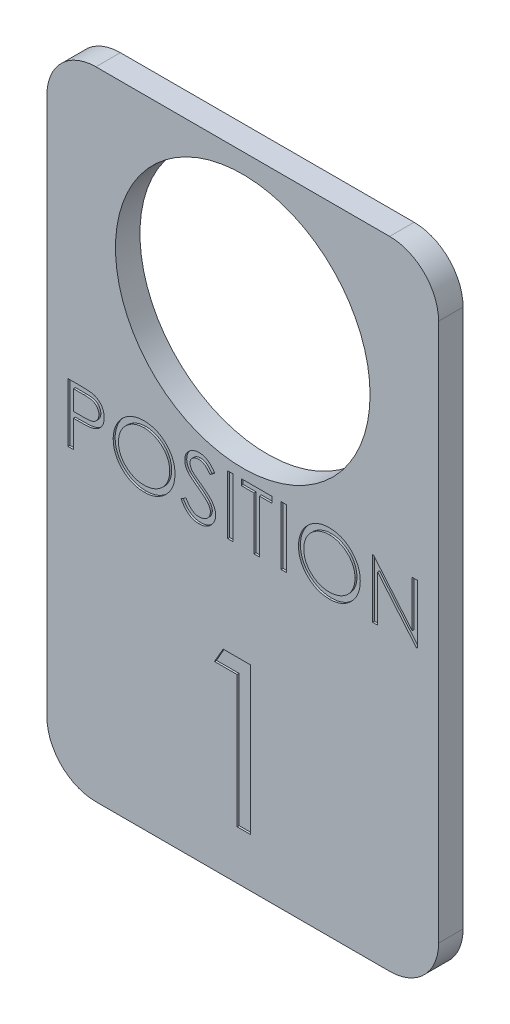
from build123d import *

# Parameters (mm, degrees)
SKETCH1_W           = 25.4
SKETCH1_H           = 41.275
SKETCH1_R           = 8.255
BOSS_EXTRUDE1_DEPTH = 1.5875
FILLET1_R           = 3.175
SKETCH2_W           = 0.341923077
SKETCH2_H           = 3.81
CUT_EXTRUDE1_DEPTH  = 0.127
CUT_EXTRUDE2_DEPTH  = 0.127


with BuildPart() as part:
    # Sketch1 → Boss-Extrude1 (new body)
    with BuildSketch(Plane.XY):
        with Locations((0, -11.1125)):
            Rectangle(SKETCH1_W, SKETCH1_H)
        Circle(SKETCH1_R, mode=Mode.SUBTRACT)
    extrude(amount=BOSS_EXTRUDE1_DEPTH)

    # Fillet1
    fillet1_edges = [part.edges().sort_by_distance(p)[0] for p in [
        (12.7, -31.75, 0.79375),
        (-12.7, -31.75, 0.79375),
        (-12.7, 9.525, 0.79375),
        (12.7, 9.525, 0.79375),
    ]]
    fillet(fillet1_edges, radius=FILLET1_R)

    # Sketch2 → Cut-Extrude1 (cut)
    # profile 1 of 8: a face of its own
    with BuildSketch(Plane.XY.offset(1.5875)):
        with BuildLine():
            Line((-11.332307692, -8.89), (-10.585114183, -8.89))
            add(Edge.make_bspline(
                [(-10.585114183, -8.89), (-10.533721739, -8.890056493), (-10.435251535, -8.890164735), (-10.294047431, -8.893446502), (-10.165803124, -8.897829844), (-10.050795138, -8.903906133), (-9.948669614, -8.911086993), (-9.859888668, -8.921158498), (-9.783754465, -8.93167442), (-9.738136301, -8.942365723), (-9.717331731, -8.947241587)],
                knots=[0, 0, 0, 0, 1.415646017, 2.712440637, 3.8905458, 4.950247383, 5.884950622, 6.709939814, 7.411656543, 8, 8, 8, 8], degree=3))
            add(Edge.make_bspline(
                [(-9.717331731, -8.947241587), (-9.690995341, -8.954450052), (-9.638943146, -8.968697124), (-9.563939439, -8.997232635), (-9.492579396, -9.031067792), (-9.424618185, -9.06962928), (-9.360890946, -9.114571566), (-9.300446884, -9.164072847), (-9.24381942, -9.219276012), (-9.191326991, -9.279561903), (-9.143119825, -9.343918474), (-9.101612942, -9.413306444), (-9.066857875, -9.486557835), (-9.037049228, -9.563621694), (-9.015595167, -9.64514516), (-8.999433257, -9.730561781), (-8.989174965, -9.819862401), (-8.988192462, -9.880887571), (-8.987692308, -9.911953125)],
                knots=[0, 0, 0, 0, 0.999701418, 1.975846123, 2.934577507, 3.890451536, 4.834027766, 5.787354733, 6.749476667, 7.726910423, 8.712836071, 9.690891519, 10.682875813, 11.679750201, 12.712814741, 13.765529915, 14.8625177, 16, 16, 16, 16], degree=3))
            add(Edge.make_bspline(
                [(-8.987692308, -9.911953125), (-8.988151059, -9.943279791), (-8.989048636, -10.004572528), (-8.999821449, -10.094241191), (-9.014332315, -10.179931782), (-9.03664482, -10.261454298), (-9.065868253, -10.338324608), (-9.100149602, -10.411717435), (-9.141497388, -10.480384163), (-9.189007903, -10.544574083), (-9.241859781, -10.604347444), (-9.299829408, -10.659271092), (-9.362682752, -10.709023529), (-9.430220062, -10.753716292), (-9.503099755, -10.792312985), (-9.580216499, -10.826883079), (-9.662240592, -10.855916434), (-9.719001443, -10.871189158), (-9.747860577, -10.878954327)],
                knots=[0, 0, 0, 0, 1.121902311, 2.195077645, 3.232258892, 4.234102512, 5.217864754, 6.176164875, 7.132989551, 8.084763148, 9.034132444, 9.988522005, 10.94243251, 11.903244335, 12.886203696, 13.894208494, 14.929344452, 16, 16, 16, 16], degree=3))
            add(Edge.make_bspline(
                [(-9.747860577, -10.878954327), (-9.771730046, -10.884030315), (-9.824041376, -10.895154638), (-9.910193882, -10.907573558), (-10.010500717, -10.918173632), (-10.12482497, -10.926121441), (-10.253064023, -10.932925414), (-10.395287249, -10.938333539), (-10.55177383, -10.94130518), (-10.660926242, -10.941458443), (-10.717914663, -10.941538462)],
                knots=[0, 0, 0, 0, 0.601384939, 1.31797006, 2.144135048, 3.087295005, 4.142315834, 5.309527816, 6.595305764, 8, 8, 8, 8], degree=3))
            Line((-10.717914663, -10.941538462), (-10.990384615, -10.941538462))
            Line((-10.990384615, -10.941538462), (-10.990384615, -12.7))
            Line((-10.990384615, -12.7), (-11.332307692, -12.7))
            Line((-11.332307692, -12.7), (-11.332307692, -8.89))
        make_face()
        with BuildLine():
            Line((-10.990384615, -9.280769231), (-10.990384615, -10.550769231))
            Line((-10.990384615, -10.550769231), (-10.323329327, -10.559164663))
            add(Edge.make_bspline(
                [(-10.323329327, -10.559164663), (-10.290759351, -10.559181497), (-10.227883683, -10.559213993), (-10.137057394, -10.554875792), (-10.052791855, -10.549867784), (-9.975345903, -10.54253525), (-9.904684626, -10.532170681), (-9.840690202, -10.521707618), (-9.783858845, -10.506570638), (-9.717348, -10.48618924), (-9.643234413, -10.451428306), (-9.562606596, -10.40097314), (-9.494276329, -10.33665957), (-9.435146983, -10.26434813), (-9.388223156, -10.183903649), (-9.353872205, -10.097831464), (-9.33368883, -10.007014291), (-9.330982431, -9.944869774), (-9.329615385, -9.913479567)],
                knots=[0, 0, 0, 0, 1.160613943, 2.240541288, 3.23993089, 4.169200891, 5.011653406, 5.7853311, 6.478053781, 7.106038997, 8.262395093, 9.384106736, 10.481365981, 11.59014053, 12.70357646, 13.786202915, 14.881775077, 16, 16, 16, 16], degree=3))
            add(Edge.make_bspline(
                [(-9.329615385, -9.913479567), (-9.330989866, -9.882848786), (-9.333722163, -9.821958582), (-9.354030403, -9.732718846), (-9.38815637, -9.647553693), (-9.435461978, -9.568117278), (-9.492874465, -9.496066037), (-9.559603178, -9.433476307), (-9.635491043, -9.383160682), (-9.706082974, -9.350685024), (-9.76878598, -9.330856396), (-9.823249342, -9.316982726), (-9.884743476, -9.305905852), (-9.953288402, -9.296936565), (-10.028352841, -9.289258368), (-10.110581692, -9.28404849), (-10.199663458, -9.280998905), (-10.261505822, -9.280847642), (-10.293563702, -9.280769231)],
                knots=[0, 0, 0, 0, 1.120700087, 2.227813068, 3.331159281, 4.466773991, 5.599788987, 6.693661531, 7.80175334, 8.91857717, 9.525282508, 10.207424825, 10.974604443, 11.810962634, 12.737642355, 13.736264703, 14.826523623, 16, 16, 16, 16], degree=3))
            Line((-10.293563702, -9.280769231), (-10.990384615, -9.280769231))
        make_face(mode=Mode.SUBTRACT)
    # profile 2 of 8: a face of its own
    with BuildSketch(Plane.XY.offset(1.5875)):
        with BuildLine():
            add(Edge.make_bspline(
                [(-6.423269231, -8.792307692), (-6.352720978, -8.79409456), (-6.21415839, -8.797604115), (-6.010514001, -8.824469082), (-5.816100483, -8.870946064), (-5.629334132, -8.932845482), (-5.452448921, -9.015418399), (-5.284113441, -9.115224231), (-5.124728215, -9.233308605), (-4.976441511, -9.368758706), (-4.840743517, -9.516133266), (-4.721190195, -9.673407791), (-4.620995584, -9.839631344), (-4.538715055, -10.01430442), (-4.474164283, -10.197031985), (-4.429620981, -10.3887882), (-4.401167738, -10.588330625), (-4.397841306, -10.724431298), (-4.396153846, -10.793473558)],
                knots=[0, 0, 0, 0, 1.065120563, 2.091984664, 3.0946048, 4.079830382, 5.057816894, 6.036188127, 7.030412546, 8.04752943, 9.064399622, 10.05169764, 11.02544977, 11.989514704, 12.962713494, 13.945757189, 14.957906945, 16, 16, 16, 16], degree=3))
            add(Edge.make_bspline(
                [(-4.396153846, -10.793473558), (-4.397841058, -10.862007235), (-4.401166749, -10.997095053), (-4.429653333, -11.195371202), (-4.474329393, -11.385969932), (-4.538115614, -11.568573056), (-4.620003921, -11.743373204), (-4.720865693, -11.909910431), (-4.839673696, -12.068239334), (-4.974881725, -12.216625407), (-5.122275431, -12.352694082), (-5.28036895, -12.471260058), (-5.445606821, -12.573285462), (-5.620115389, -12.654692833), (-5.801580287, -12.719758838), (-5.991625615, -12.764120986), (-6.189360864, -12.792736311), (-6.3242033, -12.796022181), (-6.392740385, -12.797692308)],
                knots=[0, 0, 0, 0, 1.043624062, 2.057103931, 3.04512605, 4.022047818, 4.998200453, 5.980619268, 6.982898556, 8.009068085, 9.034988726, 10.034168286, 11.015286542, 11.987931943, 12.962482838, 13.94673481, 14.956375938, 16, 16, 16, 16], degree=3))
            add(Edge.make_bspline(
                [(-6.392740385, -12.797692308), (-6.461782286, -12.796005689), (-6.597882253, -12.792680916), (-6.797675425, -12.764180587), (-6.989566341, -12.719613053), (-7.173006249, -12.655921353), (-7.348097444, -12.573606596), (-7.515182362, -12.473235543), (-7.673590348, -12.354138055), (-7.822008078, -12.21897387), (-7.957806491, -12.07182998), (-8.07619884, -11.914167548), (-8.176592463, -11.749079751), (-8.258630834, -11.576108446), (-8.323579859, -11.396089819), (-8.367889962, -11.207823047), (-8.396558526, -11.012381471), (-8.399862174, -10.879311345), (-8.401538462, -10.811790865)],
                knots=[0, 0, 0, 0, 1.053102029, 2.075944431, 3.073151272, 4.055350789, 5.033113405, 6.020478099, 7.024410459, 8.052272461, 9.079885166, 10.07527673, 11.055994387, 12.023226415, 12.992069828, 13.970394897, 14.97016774, 16, 16, 16, 16], degree=3))
            add(Edge.make_bspline(
                [(-8.401538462, -10.811790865), (-8.400956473, -10.766470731), (-8.399799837, -10.676402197), (-8.385875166, -10.542653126), (-8.365669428, -10.41105501), (-8.336711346, -10.281982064), (-8.298838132, -10.155750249), (-8.254150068, -10.03148899), (-8.199569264, -9.910457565), (-8.13786833, -9.792082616), (-8.069003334, -9.678209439), (-7.992938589, -9.57057195), (-7.912345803, -9.468266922), (-7.823993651, -9.373945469), (-7.730794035, -9.284863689), (-7.631235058, -9.20239056), (-7.525924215, -9.125782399), (-7.414408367, -9.056744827), (-7.299435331, -8.994305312), (-7.180915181, -8.940723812), (-7.060457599, -8.894735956), (-6.937498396, -8.857462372), (-6.812364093, -8.82803607), (-6.684781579, -8.807998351), (-6.554852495, -8.794038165), (-6.467319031, -8.792886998), (-6.423269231, -8.792307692)],
                knots=[0, 0, 0, 0, 1.037015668, 2.060948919, 3.074880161, 4.083647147, 5.086022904, 6.090072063, 7.104153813, 8.122640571, 9.144368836, 10.147691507, 11.138137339, 12.123020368, 13.103399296, 14.087645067, 15.080126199, 16.082011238, 17.087798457, 18.072939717, 19.057185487, 20.037253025, 21.01195951, 21.997135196, 22.992090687, 24, 24, 24, 24], degree=3))
        make_face()
        with BuildLine():
            add(Edge.make_bspline(
                [(-6.406478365, -9.183076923), (-6.442634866, -9.183517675), (-6.51460221, -9.184394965), (-6.621591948, -9.19595093), (-6.727174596, -9.212420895), (-6.831371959, -9.235913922), (-6.933748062, -9.267922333), (-7.035257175, -9.304760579), (-7.134973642, -9.349632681), (-7.232568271, -9.400330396), (-7.327181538, -9.456445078), (-7.416458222, -9.518462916), (-7.500629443, -9.584929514), (-7.579489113, -9.655999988), (-7.652805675, -9.732036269), (-7.722022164, -9.811885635), (-7.784364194, -9.897830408), (-7.841498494, -9.987540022), (-7.892626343, -10.080897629), (-7.938090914, -10.176920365), (-7.975280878, -10.276391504), (-8.005611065, -10.378231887), (-8.030756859, -10.482280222), (-8.046686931, -10.589325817), (-8.058369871, -10.698830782), (-8.059197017, -10.772833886), (-8.059615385, -10.810264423)],
                knots=[0, 0, 0, 0, 1.008559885, 2.007477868, 2.99961109, 3.989939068, 4.984837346, 5.991145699, 7.001802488, 8.033829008, 9.059044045, 10.069351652, 11.065060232, 12.050310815, 13.029377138, 14.011219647, 14.996725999, 15.989392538, 16.977580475, 17.965360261, 18.951710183, 19.937753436, 20.929683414, 21.935841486, 22.955955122, 24, 24, 24, 24], degree=3))
            add(Edge.make_bspline(
                [(-8.059615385, -10.810264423), (-8.058227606, -10.865305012), (-8.055497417, -10.973586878), (-8.031595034, -11.132265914), (-7.994777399, -11.28476202), (-7.940504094, -11.430240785), (-7.872630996, -11.569952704), (-7.788781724, -11.702658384), (-7.689439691, -11.82839369), (-7.576594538, -11.946280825), (-7.453234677, -12.053881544), (-7.322243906, -12.148329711), (-7.18502555, -12.228242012), (-7.041221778, -12.293344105), (-6.891600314, -12.344931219), (-6.735197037, -12.380286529), (-6.573053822, -12.403555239), (-6.462530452, -12.405789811), (-6.406478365, -12.406923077)],
                knots=[0, 0, 0, 0, 1.032063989, 2.030389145, 3.003944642, 3.970395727, 4.937377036, 5.913328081, 6.909231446, 7.93887556, 8.970685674, 9.976071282, 10.964166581, 11.944589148, 12.933237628, 13.927779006, 14.949070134, 16, 16, 16, 16], degree=3))
            add(Edge.make_bspline(
                [(-6.406478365, -12.406923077), (-6.368803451, -12.406405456), (-6.29408278, -12.40537886), (-6.182944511, -12.395038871), (-6.073808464, -12.378457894), (-5.966827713, -12.354584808), (-5.862123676, -12.324706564), (-5.759259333, -12.289210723), (-5.659330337, -12.244926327), (-5.561076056, -12.195997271), (-5.467027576, -12.140218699), (-5.377247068, -12.080305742), (-5.293997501, -12.013937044), (-5.215196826, -11.943922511), (-5.141579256, -11.868850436), (-5.073642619, -11.788818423), (-5.011615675, -11.703321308), (-4.954503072, -11.613747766), (-4.903554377, -11.520134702), (-4.859163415, -11.423763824), (-4.821503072, -11.324872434), (-4.791100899, -11.223317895), (-4.767277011, -11.119293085), (-4.750861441, -11.01265872), (-4.739378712, -10.903628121), (-4.738513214, -10.829884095), (-4.738076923, -10.792710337)],
                knots=[0, 0, 0, 0, 1.047197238, 2.076906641, 3.100256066, 4.114471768, 5.12198147, 6.126382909, 7.136867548, 8.15857795, 9.17633901, 10.174870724, 11.156907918, 12.133735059, 13.104061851, 14.077631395, 15.04955518, 16.038496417, 17.029181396, 18.010275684, 18.986308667, 19.968651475, 20.955262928, 21.950658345, 22.966943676, 24, 24, 24, 24], degree=3))
            add(Edge.make_bspline(
                [(-4.738076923, -10.792710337), (-4.738513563, -10.755790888), (-4.739379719, -10.68255436), (-4.750855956, -10.574284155), (-4.767294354, -10.468417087), (-4.790984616, -10.365368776), (-4.821519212, -10.265112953), (-4.859169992, -10.167743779), (-4.903567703, -10.072898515), (-4.954521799, -9.980811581), (-5.011797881, -9.89244708), (-5.074384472, -9.807971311), (-5.143362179, -9.728970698), (-5.216760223, -9.653494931), (-5.296411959, -9.583153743), (-5.381956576, -9.517923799), (-5.472355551, -9.456230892), (-5.568070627, -9.400577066), (-5.666851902, -9.349181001), (-5.768213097, -9.305147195), (-5.871005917, -9.267730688), (-5.974968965, -9.235817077), (-6.080977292, -9.212512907), (-6.188314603, -9.195936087), (-6.296832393, -9.184398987), (-6.369813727, -9.18351901), (-6.406478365, -9.183076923)],
                knots=[0, 0, 0, 0, 1.02996197, 2.043119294, 3.035359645, 4.018872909, 4.991431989, 5.957985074, 6.929999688, 7.912076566, 8.892894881, 9.867085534, 10.843653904, 11.817741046, 12.803660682, 13.806313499, 14.818574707, 15.856120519, 16.894564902, 17.924820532, 18.937903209, 19.946497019, 20.957711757, 21.963978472, 22.977135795, 24, 24, 24, 24], degree=3))
        make_face(mode=Mode.SUBTRACT)
    # profile 3 of 8: a face of its own
    with BuildSketch(Plane.XY.offset(1.5875)):
        with BuildLine():
            Line((-4.005384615, -11.965018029), (-3.683305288, -11.771923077))
            add(Edge.make_bspline(
                [(-3.683305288, -11.771923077), (-3.653349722, -11.82206745), (-3.595956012, -11.918142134), (-3.500214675, -12.04796303), (-3.401009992, -12.158302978), (-3.297607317, -12.248520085), (-3.190637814, -12.319548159), (-3.079403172, -12.369842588), (-2.964278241, -12.401210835), (-2.885929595, -12.40502093), (-2.846814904, -12.406923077)],
                knots=[0, 0, 0, 0, 1.272034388, 2.437168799, 3.508375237, 4.49857839, 5.41946034, 6.295179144, 7.148887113, 8, 8, 8, 8], degree=3))
            add(Edge.make_bspline(
                [(-2.846814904, -12.406923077), (-2.813410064, -12.405992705), (-2.747184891, -12.40414824), (-2.649689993, -12.386425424), (-2.555004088, -12.359197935), (-2.465078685, -12.320204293), (-2.381154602, -12.273027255), (-2.307559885, -12.216044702), (-2.243937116, -12.152247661), (-2.19189348, -12.081073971), (-2.151964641, -12.004528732), (-2.121275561, -11.925960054), (-2.104244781, -11.844133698), (-2.101679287, -11.789040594), (-2.100384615, -11.761237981)],
                knots=[0, 0, 0, 0, 1.095163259, 2.171163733, 3.241058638, 4.321873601, 5.38011039, 6.391990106, 7.366004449, 8.327778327, 9.272591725, 10.192022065, 11.087607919, 12, 12, 12, 12], degree=3))
            add(Edge.make_bspline(
                [(-2.100384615, -11.761237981), (-2.101989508, -11.729516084), (-2.10525202, -11.665030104), (-2.132827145, -11.569889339), (-2.176205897, -11.475735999), (-2.21622466, -11.41749605), (-2.237001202, -11.387259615)],
                knots=[0, 0, 0, 0, 0.938893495, 1.908633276, 2.914225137, 4, 4, 4, 4], degree=3))
            add(Edge.make_bspline(
                [(-2.237001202, -11.387259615), (-2.254059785, -11.365437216), (-2.289872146, -11.319623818), (-2.351439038, -11.251430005), (-2.423683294, -11.18108824), (-2.504132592, -11.105912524), (-2.595717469, -11.029399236), (-2.69556942, -10.947899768), (-2.806237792, -10.86451348), (-2.883852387, -10.808590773), (-2.92390024, -10.779735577)],
                knots=[0, 0, 0, 0, 0.722233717, 1.516239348, 2.393582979, 3.351407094, 4.387010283, 5.505090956, 6.712668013, 8, 8, 8, 8], degree=3))
            add(Edge.make_bspline(
                [(-2.92390024, -10.779735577), (-2.963985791, -10.751183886), (-3.04062631, -10.696595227), (-3.14780551, -10.615579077), (-3.243648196, -10.541508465), (-3.327728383, -10.473686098), (-3.400009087, -10.412102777), (-3.461059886, -10.357349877), (-3.509325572, -10.307946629), (-3.536164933, -10.275897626), (-3.548215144, -10.261508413)],
                knots=[0, 0, 0, 0, 1.452282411, 2.77665338, 3.964542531, 5.026858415, 5.96415736, 6.766646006, 7.446254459, 8, 8, 8, 8], degree=3))
            add(Edge.make_bspline(
                [(-3.548215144, -10.261508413), (-3.565058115, -10.239082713), (-3.598182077, -10.194979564), (-3.641905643, -10.126045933), (-3.67906856, -10.055481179), (-3.70820127, -9.983095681), (-3.732733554, -9.909905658), (-3.749234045, -9.834956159), (-3.759566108, -9.758583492), (-3.760624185, -9.707188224), (-3.761153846, -9.681460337)],
                knots=[0, 0, 0, 0, 1.068054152, 2.10047183, 3.106115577, 4.101338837, 5.06977816, 6.043150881, 7.020423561, 8, 8, 8, 8], degree=3))
            add(Edge.make_bspline(
                [(-3.761153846, -9.681460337), (-3.759733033, -9.641150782), (-3.756921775, -9.561393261), (-3.733146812, -9.444882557), (-3.695620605, -9.333645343), (-3.64304817, -9.228782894), (-3.575276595, -9.13302564), (-3.496849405, -9.045272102), (-3.403437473, -8.971501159), (-3.300945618, -8.907044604), (-3.188761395, -8.856593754), (-3.071205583, -8.81853623), (-2.948091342, -8.796972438), (-2.864703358, -8.793877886), (-2.822391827, -8.792307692)],
                knots=[0, 0, 0, 0, 1.005424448, 1.989358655, 2.955360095, 3.929531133, 4.905563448, 5.876582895, 6.856512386, 7.866279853, 8.892233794, 9.918561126, 10.94386622, 12, 12, 12, 12], degree=3))
            add(Edge.make_bspline(
                [(-2.822391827, -8.792307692), (-2.777494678, -8.793856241), (-2.688208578, -8.796935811), (-2.556873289, -8.823711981), (-2.430424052, -8.868017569), (-2.328704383, -8.918297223), (-2.249094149, -8.968514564), (-2.188381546, -9.014256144), (-2.126858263, -9.066915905), (-2.064028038, -9.126634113), (-2.000955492, -9.193958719), (-1.936704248, -9.26842864), (-1.871124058, -9.349588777), (-1.828935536, -9.407527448), (-1.807307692, -9.437229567)],
                knots=[0, 0, 0, 0, 1.286793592, 2.559021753, 3.825965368, 5.121522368, 5.803751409, 6.523245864, 7.299691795, 8.125521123, 9.008227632, 9.944561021, 10.946284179, 12, 12, 12, 12], degree=3))
            Line((-1.807307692, -9.437229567), (-2.11641226, -9.671538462))
            add(Edge.make_bspline(
                [(-2.11641226, -9.671538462), (-2.135076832, -9.647493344), (-2.171020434, -9.60118807), (-2.225589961, -9.536340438), (-2.277023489, -9.477104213), (-2.327696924, -9.425652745), (-2.374933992, -9.379168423), (-2.420781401, -9.339370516), (-2.464579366, -9.305869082), (-2.519788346, -9.270116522), (-2.589149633, -9.234676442), (-2.676218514, -9.204687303), (-2.767208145, -9.186665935), (-2.829180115, -9.184283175), (-2.860552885, -9.183076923)],
                knots=[0, 0, 0, 0, 1.181633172, 2.275549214, 3.290209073, 4.226197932, 5.078386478, 5.862611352, 6.581680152, 7.217281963, 8.414376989, 9.595101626, 10.782541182, 12, 12, 12, 12], degree=3))
            add(Edge.make_bspline(
                [(-2.860552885, -9.183076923), (-2.899911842, -9.184395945), (-2.975811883, -9.186939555), (-3.083569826, -9.214719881), (-3.180554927, -9.258460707), (-3.263887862, -9.319763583), (-3.333270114, -9.392394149), (-3.3834592, -9.475973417), (-3.413667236, -9.568265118), (-3.417353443, -9.632645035), (-3.419230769, -9.665432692)],
                knots=[0, 0, 0, 0, 1.14458467, 2.207223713, 3.21896685, 4.227309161, 5.202851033, 6.127160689, 7.046193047, 8, 8, 8, 8], degree=3))
            add(Edge.make_bspline(
                [(-3.419230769, -9.665432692), (-3.418802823, -9.685845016), (-3.41794623, -9.726703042), (-3.405999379, -9.787065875), (-3.390651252, -9.847276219), (-3.366329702, -9.907063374), (-3.332752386, -9.967472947), (-3.288659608, -10.029545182), (-3.233127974, -10.093827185), (-3.190589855, -10.135636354), (-3.16813101, -10.157710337)],
                knots=[0, 0, 0, 0, 0.858281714, 1.717966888, 2.583508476, 3.4729293, 4.427298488, 5.488583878, 6.674047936, 8, 8, 8, 8], degree=3))
            add(Edge.make_bspline(
                [(-3.16813101, -10.157710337), (-3.159791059, -10.165152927), (-3.139977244, -10.18283482), (-3.103754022, -10.211782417), (-3.055919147, -10.247490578), (-2.997721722, -10.291672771), (-2.92808868, -10.342924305), (-2.847012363, -10.400589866), (-2.755396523, -10.466541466), (-2.690384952, -10.512650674), (-2.656009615, -10.53703125)],
                knots=[0, 0, 0, 0, 0.420754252, 0.999615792, 1.744751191, 2.668019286, 3.750313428, 4.999500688, 6.413464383, 8, 8, 8, 8], degree=3))
            add(Edge.make_bspline(
                [(-2.656009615, -10.53703125), (-2.614659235, -10.567120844), (-2.534589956, -10.625385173), (-2.420662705, -10.712923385), (-2.317364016, -10.798537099), (-2.224331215, -10.88167958), (-2.140645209, -10.961720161), (-2.067234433, -11.039621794), (-2.003350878, -11.114826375), (-1.934575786, -11.21124395), (-1.864299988, -11.32965993), (-1.803947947, -11.474742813), (-1.765893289, -11.620389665), (-1.760916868, -11.718281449), (-1.758461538, -11.766580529)],
                knots=[0, 0, 0, 0, 1.163667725, 2.253281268, 3.268753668, 4.215851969, 5.092017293, 5.902905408, 6.650798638, 7.335211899, 8.59617414, 9.77448103, 10.901945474, 12, 12, 12, 12], degree=3))
            add(Edge.make_bspline(
                [(-1.758461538, -11.766580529), (-1.75917688, -11.800738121), (-1.760593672, -11.868389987), (-1.776879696, -11.967727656), (-1.800740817, -12.064208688), (-1.836704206, -12.156640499), (-1.880598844, -12.246714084), (-1.936296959, -12.332066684), (-2.00085761, -12.414587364), (-2.074917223, -12.492075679), (-2.155956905, -12.563209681), (-2.241609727, -12.626487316), (-2.332015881, -12.679248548), (-2.426684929, -12.722302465), (-2.525638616, -12.755975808), (-2.62884366, -12.780373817), (-2.736470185, -12.795347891), (-2.80962271, -12.796902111), (-2.846814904, -12.797692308)],
                knots=[0, 0, 0, 0, 0.983748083, 1.948392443, 2.894712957, 3.844097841, 4.80183111, 5.778335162, 6.776009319, 7.81870978, 8.863265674, 9.881300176, 10.883814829, 11.87499822, 12.874611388, 13.892143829, 14.928324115, 16, 16, 16, 16], degree=3))
            add(Edge.make_bspline(
                [(-2.846814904, -12.797692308), (-2.875591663, -12.79713585), (-2.932782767, -12.796029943), (-3.017375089, -12.786253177), (-3.100258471, -12.772420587), (-3.180392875, -12.750459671), (-3.258810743, -12.723814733), (-3.335171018, -12.691007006), (-3.409510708, -12.651690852), (-3.48224642, -12.606738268), (-3.553193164, -12.55442398), (-3.621685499, -12.493492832), (-3.689970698, -12.425625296), (-3.756033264, -12.348978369), (-3.821209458, -12.264790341), (-3.884214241, -12.172273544), (-3.946351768, -12.071931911), (-3.985339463, -12.001321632), (-4.005384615, -11.965018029)],
                knots=[0, 0, 0, 0, 0.915332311, 1.819136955, 2.706846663, 3.586547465, 4.459518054, 5.340707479, 6.227863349, 7.133153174, 8.059268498, 9.028702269, 10.047606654, 11.120612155, 12.245963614, 13.433783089, 14.680604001, 16, 16, 16, 16], degree=3))
        make_face()
    # profile 4 of 8: a face of its own
    with BuildSketch(Plane.XY.offset(1.5875)):
        with Locations((-0.805961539, -10.795)):
            Rectangle(SKETCH2_W, SKETCH2_H)
    # profile 5 of 8: a face of its own
    with BuildSketch(Plane.XY.offset(1.5875)):
        Polygon((-0.097692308, -9.280769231), (-0.097692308, -8.89), (1.905, -8.89), (1.905, -9.280769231), (1.074615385, -9.280769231), (1.074615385, -12.7), (0.732692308, -12.7), (0.732692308, -9.280769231), align=None)
    # profile 6 of 8: a face of its own
    with BuildSketch(Plane.XY.offset(1.5875)):
        with Locations((2.662115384, -10.795)):
            Rectangle(SKETCH2_W, SKETCH2_H)
    # profile 7 of 8: a face of its own
    with BuildSketch(Plane.XY.offset(1.5875)):
        with BuildLine():
            add(Edge.make_bspline(
                [(5.592884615, -8.792307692), (5.663432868, -8.79409456), (5.801995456, -8.797604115), (6.005639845, -8.824469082), (6.200053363, -8.870946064), (6.386819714, -8.932845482), (6.563704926, -9.015418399), (6.732040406, -9.115224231), (6.891425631, -9.233308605), (7.039712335, -9.368758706), (7.17541033, -9.516133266), (7.294963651, -9.673407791), (7.395158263, -9.839631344), (7.477438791, -10.01430442), (7.541989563, -10.197031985), (7.586532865, -10.3887882), (7.614986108, -10.588330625), (7.61831254, -10.724431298), (7.62, -10.793473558)],
                knots=[0, 0, 0, 0, 1.065120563, 2.091984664, 3.0946048, 4.079830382, 5.057816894, 6.036188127, 7.030412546, 8.04752943, 9.064399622, 10.05169764, 11.02544977, 11.989514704, 12.962713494, 13.945757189, 14.957906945, 16, 16, 16, 16], degree=3))
            add(Edge.make_bspline(
                [(7.62, -10.793473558), (7.618312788, -10.862007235), (7.614987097, -10.997095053), (7.586500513, -11.195371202), (7.541824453, -11.385969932), (7.478038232, -11.568573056), (7.396149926, -11.743373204), (7.295288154, -11.909910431), (7.17648015, -12.068239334), (7.041272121, -12.216625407), (6.893878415, -12.352694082), (6.735784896, -12.471260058), (6.570547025, -12.573285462), (6.396038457, -12.654692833), (6.21457356, -12.719758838), (6.024528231, -12.764120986), (5.826792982, -12.792736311), (5.691950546, -12.796022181), (5.623413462, -12.797692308)],
                knots=[0, 0, 0, 0, 1.043624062, 2.057103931, 3.04512605, 4.022047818, 4.998200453, 5.980619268, 6.982898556, 8.009068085, 9.034988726, 10.034168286, 11.015286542, 11.987931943, 12.962482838, 13.94673481, 14.956375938, 16, 16, 16, 16], degree=3))
            add(Edge.make_bspline(
                [(5.623413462, -12.797692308), (5.55437156, -12.796005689), (5.418271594, -12.792680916), (5.218478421, -12.764180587), (5.026587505, -12.719613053), (4.843147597, -12.655921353), (4.668056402, -12.573606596), (4.500971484, -12.473235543), (4.342563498, -12.354138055), (4.194145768, -12.21897387), (4.058347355, -12.07182998), (3.939955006, -11.914167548), (3.839561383, -11.749079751), (3.757523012, -11.576108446), (3.692573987, -11.396089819), (3.648263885, -11.207823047), (3.61959532, -11.012381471), (3.616291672, -10.879311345), (3.614615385, -10.811790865)],
                knots=[0, 0, 0, 0, 1.053102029, 2.075944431, 3.073151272, 4.055350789, 5.033113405, 6.020478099, 7.024410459, 8.052272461, 9.079885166, 10.07527673, 11.055994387, 12.023226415, 12.992069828, 13.970394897, 14.97016774, 16, 16, 16, 16], degree=3))
            add(Edge.make_bspline(
                [(3.614615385, -10.811790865), (3.615197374, -10.766470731), (3.616354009, -10.676402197), (3.63027868, -10.542653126), (3.650484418, -10.41105501), (3.6794425, -10.281982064), (3.717315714, -10.155750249), (3.762003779, -10.03148899), (3.816584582, -9.910457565), (3.878285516, -9.792082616), (3.947150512, -9.678209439), (4.023215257, -9.57057195), (4.103808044, -9.468266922), (4.192160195, -9.373945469), (4.285359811, -9.284863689), (4.384918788, -9.20239056), (4.490229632, -9.125782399), (4.601745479, -9.056744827), (4.716718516, -8.994305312), (4.835238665, -8.940723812), (4.955696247, -8.894735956), (5.07865545, -8.857462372), (5.203789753, -8.82803607), (5.331372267, -8.807998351), (5.461301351, -8.794038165), (5.548834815, -8.792886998), (5.592884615, -8.792307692)],
                knots=[0, 0, 0, 0, 1.037015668, 2.060948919, 3.074880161, 4.083647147, 5.086022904, 6.090072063, 7.104153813, 8.122640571, 9.144368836, 10.147691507, 11.138137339, 12.123020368, 13.103399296, 14.087645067, 15.080126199, 16.082011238, 17.087798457, 18.072939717, 19.057185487, 20.037253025, 21.01195951, 21.997135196, 22.992090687, 24, 24, 24, 24], degree=3))
        make_face()
        with BuildLine():
            add(Edge.make_bspline(
                [(5.609675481, -9.183076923), (5.57351898, -9.183517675), (5.501551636, -9.184394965), (5.394561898, -9.19595093), (5.28897925, -9.212420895), (5.184781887, -9.235913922), (5.082405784, -9.267922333), (4.980896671, -9.304760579), (4.881180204, -9.349632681), (4.783585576, -9.400330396), (4.688972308, -9.456445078), (4.599695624, -9.518462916), (4.515524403, -9.584929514), (4.436664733, -9.655999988), (4.363348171, -9.732036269), (4.294131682, -9.811885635), (4.231789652, -9.897830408), (4.174655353, -9.987540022), (4.123527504, -10.080897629), (4.078062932, -10.176920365), (4.040872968, -10.276391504), (4.010542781, -10.378231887), (3.985396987, -10.482280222), (3.969466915, -10.589325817), (3.957783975, -10.698830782), (3.956956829, -10.772833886), (3.956538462, -10.810264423)],
                knots=[0, 0, 0, 0, 1.008559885, 2.007477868, 2.99961109, 3.989939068, 4.984837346, 5.991145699, 7.001802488, 8.033829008, 9.059044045, 10.069351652, 11.065060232, 12.050310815, 13.029377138, 14.011219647, 14.996725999, 15.989392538, 16.977580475, 17.965360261, 18.951710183, 19.937753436, 20.929683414, 21.935841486, 22.955955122, 24, 24, 24, 24], degree=3))
            add(Edge.make_bspline(
                [(3.956538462, -10.810264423), (3.95792624, -10.865305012), (3.960656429, -10.973586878), (3.984558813, -11.132265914), (4.021376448, -11.28476202), (4.075649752, -11.430240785), (4.14352285, -11.569952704), (4.227372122, -11.702658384), (4.326714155, -11.82839369), (4.439559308, -11.946280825), (4.562919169, -12.053881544), (4.693909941, -12.148329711), (4.831128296, -12.228242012), (4.974932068, -12.293344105), (5.124553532, -12.344931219), (5.280956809, -12.380286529), (5.443100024, -12.403555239), (5.553623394, -12.405789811), (5.609675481, -12.406923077)],
                knots=[0, 0, 0, 0, 1.032063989, 2.030389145, 3.003944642, 3.970395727, 4.937377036, 5.913328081, 6.909231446, 7.93887556, 8.970685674, 9.976071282, 10.964166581, 11.944589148, 12.933237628, 13.927779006, 14.949070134, 16, 16, 16, 16], degree=3))
            add(Edge.make_bspline(
                [(5.609675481, -12.406923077), (5.647350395, -12.406405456), (5.722071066, -12.40537886), (5.833209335, -12.395038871), (5.942345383, -12.378457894), (6.049326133, -12.354584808), (6.154030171, -12.324706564), (6.256894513, -12.289210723), (6.356823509, -12.244926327), (6.45507779, -12.195997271), (6.54912627, -12.140218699), (6.638906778, -12.080305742), (6.722156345, -12.013937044), (6.80095702, -11.943922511), (6.87457459, -11.868850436), (6.942511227, -11.788818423), (7.004538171, -11.703321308), (7.061650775, -11.613747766), (7.112599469, -11.520134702), (7.156990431, -11.423763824), (7.194650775, -11.324872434), (7.225052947, -11.223317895), (7.248876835, -11.119293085), (7.265292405, -11.01265872), (7.276775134, -10.903628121), (7.277640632, -10.829884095), (7.278076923, -10.792710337)],
                knots=[0, 0, 0, 0, 1.047197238, 2.076906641, 3.100256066, 4.114471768, 5.12198147, 6.126382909, 7.136867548, 8.15857795, 9.17633901, 10.174870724, 11.156907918, 12.133735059, 13.104061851, 14.077631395, 15.04955518, 16.038496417, 17.029181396, 18.010275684, 18.986308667, 19.968651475, 20.955262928, 21.950658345, 22.966943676, 24, 24, 24, 24], degree=3))
            add(Edge.make_bspline(
                [(7.278076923, -10.792710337), (7.277640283, -10.755790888), (7.276774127, -10.68255436), (7.26529789, -10.574284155), (7.248859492, -10.468417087), (7.22516923, -10.365368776), (7.194634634, -10.265112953), (7.156983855, -10.167743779), (7.112586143, -10.072898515), (7.061632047, -9.980811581), (7.004355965, -9.89244708), (6.941769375, -9.807971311), (6.872791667, -9.728970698), (6.799393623, -9.653494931), (6.719741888, -9.583153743), (6.63419727, -9.517923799), (6.543798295, -9.456230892), (6.448083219, -9.400577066), (6.349301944, -9.349181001), (6.247940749, -9.305147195), (6.14514793, -9.267730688), (6.041184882, -9.235817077), (5.935176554, -9.212512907), (5.827839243, -9.195936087), (5.719321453, -9.184398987), (5.646340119, -9.18351901), (5.609675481, -9.183076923)],
                knots=[0, 0, 0, 0, 1.02996197, 2.043119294, 3.035359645, 4.018872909, 4.991431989, 5.957985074, 6.929999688, 7.912076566, 8.892894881, 9.867085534, 10.843653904, 11.817741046, 12.803660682, 13.806313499, 14.818574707, 15.856120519, 16.894564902, 17.924820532, 18.937903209, 19.946497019, 20.957711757, 21.963978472, 22.977135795, 24, 24, 24, 24], degree=3))
        make_face(mode=Mode.SUBTRACT)
    # profile 8 of 8: a face of its own
    with BuildSketch(Plane.XY.offset(1.5875)):
        Polygon((8.401538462, -12.7), (8.401538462, -8.89), (8.47328125, -8.89), (10.990384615, -11.888695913), (10.990384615, -8.89), (11.332307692, -8.89), (11.332307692, -12.7), (11.254459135, -12.7), (8.743461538, -9.708173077), (8.743461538, -12.7), align=None)
    extrude(amount=-CUT_EXTRUDE1_DEPTH, mode=Mode.SUBTRACT)

    # Sketch3 → Cut-Extrude2 (cut)
    with BuildSketch(Plane.XY.offset(1.5875)):
        Polygon((-1.272671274, -19.05), (0.488461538, -19.05), (0.488461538, -28.575), (-0.366346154, -28.575), (-0.366346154, -20.026923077), (-1.831730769, -20.026923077), align=None)
    extrude(amount=-CUT_EXTRUDE2_DEPTH, mode=Mode.SUBTRACT)


solid = part.part
